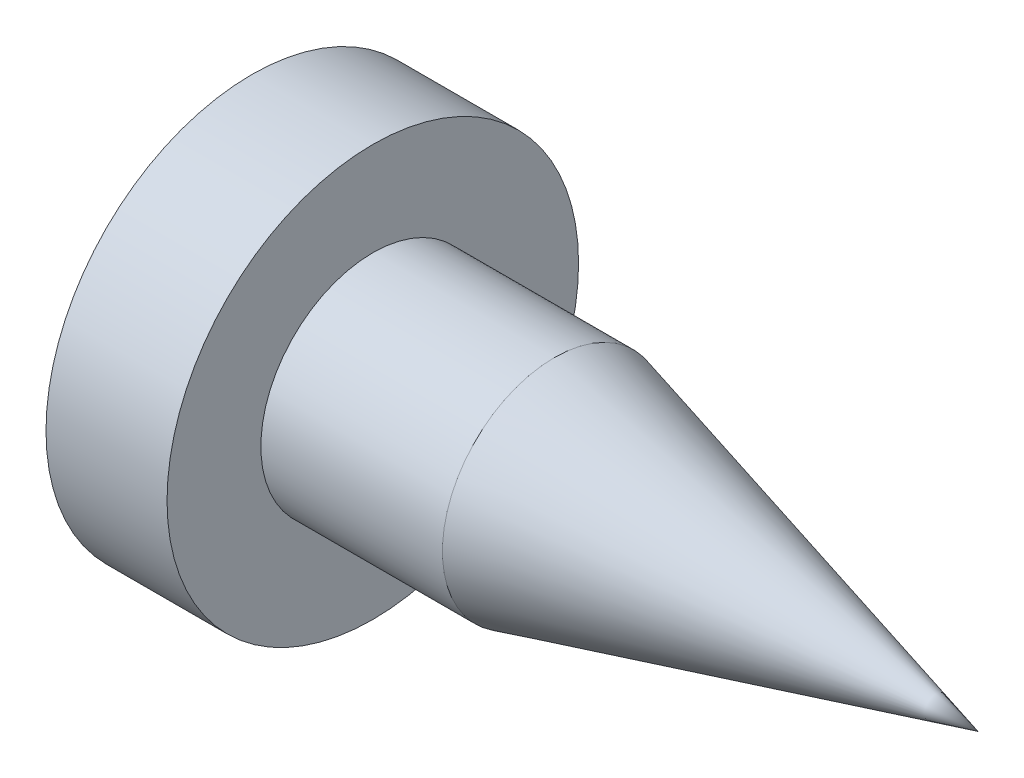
from build123d import *

# Parameters (mm, degrees)
ENL_V_MAT_EXTRU_1_DEPTH = 10


with BuildPart() as part:
    # Esquisse1 → Base-R_volution (revolve)
    with BuildSketch(Plane.XY, mode=Mode.PRIVATE) as base_r_volution_sk:
        with BuildLine():
            Line((0, 1.85), (3, 1.85))
            Line((3, 1.85), (10, 0))
            Line((10, 0), (-3, 0))
            ThreePointArc((-3, 0), (-2.74481535, 1.772004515), (-2, 3.4))
            Line((-2, 3.4), (0, 3.4))
            Line((0, 3.4), (0, 1.85))
        make_face()
    revolve(base_r_volution_sk.sketch.rotate(Axis((-2, 0, 0), (1, 0, 0)), 180), axis=Axis((-2, 0, 0), (1, 0, 0)))

    # Esquisse2 → Enl_v. mat.-Extru.1 (cut)
    with BuildSketch(Plane(origin=(-1, 0, 0), x_dir=(0, 0, -1), z_dir=(1, 0, 0))):
        with BuildLine():
            Line((0.7, -0.5), (2, -0.5))
            Line((2, -0.5), (2, 0.5))
            Line((2, 0.5), (0.7, 0.5))
            ThreePointArc((0.7, 0.5), (0.558578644, 0.558578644), (0.5, 0.7))
            Line((0.5, 0.7), (0.5, 2))
            Line((0.5, 2), (-0.5, 2))
            Line((-0.5, 2), (-0.5, 0.7))
            ThreePointArc((-0.5, 0.7), (-0.558578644, 0.558578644), (-0.7, 0.5))
            Line((-0.7, 0.5), (-2, 0.5))
            Line((-2, 0.5), (-2, -0.5))
            Line((-2, -0.5), (-0.7, -0.5))
            ThreePointArc((-0.7, -0.5), (-0.558578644, -0.558578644), (-0.5, -0.7))
            Line((-0.5, -0.7), (-0.5, -2))
            Line((-0.5, -2), (0.5, -2))
            Line((0.5, -2), (0.5, -0.7))
            ThreePointArc((0.5, -0.7), (0.558578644, -0.558578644), (0.7, -0.5))
        make_face()
    extrude(amount=-ENL_V_MAT_EXTRU_1_DEPTH, mode=Mode.SUBTRACT)


solid = part.part
